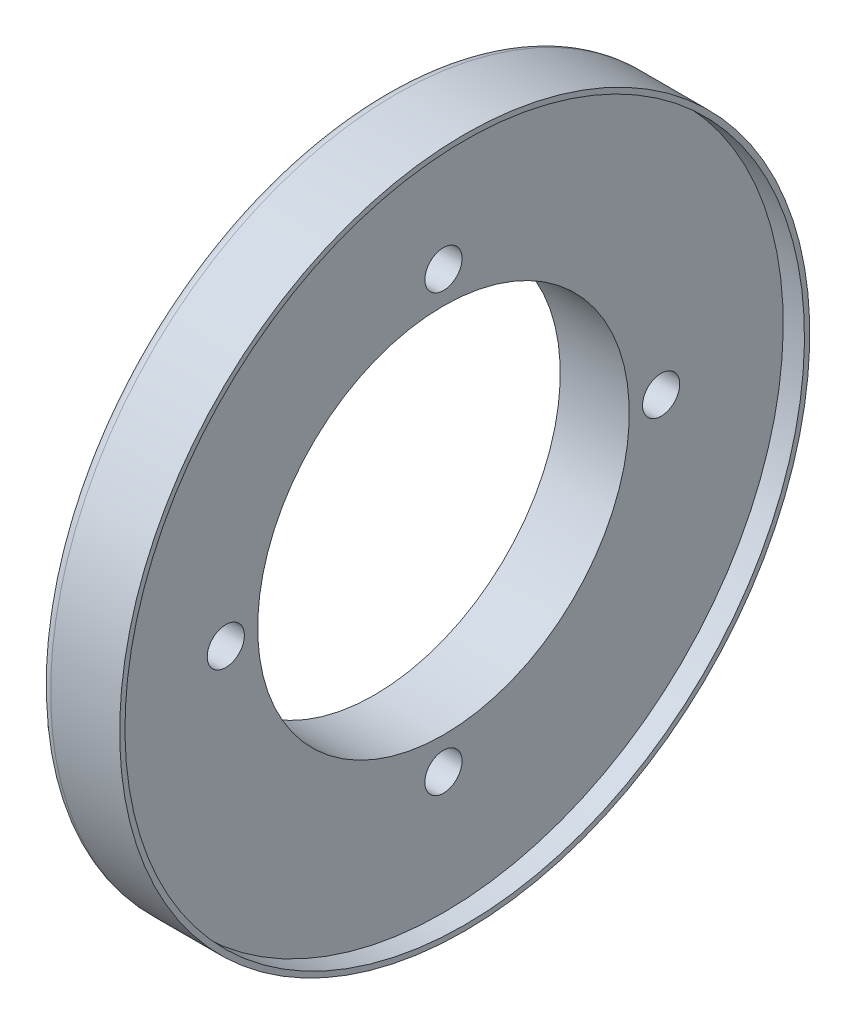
from build123d import *

# Parameters (mm, degrees)
SKIZZE2_R                       = 3.5
SCHNITT_LINEAR_AUSTRAGEN1_DEPTH = 93.838569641


with BuildPart() as part:
    # Skizze1 → Rotation1 (revolve)
    with BuildSketch(Plane.XY, mode=Mode.PRIVATE) as rotation1_sk:
        with BuildLine():
            Line((0, 35), (0, 47))
            Line((0, 47), (2, 47))
            Line((2, 47), (2, 63))
            ThreePointArc((2, 63), (2.585786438, 64.414213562), (4, 65))
            Line((4, 65), (17, 65))
            Line((17, 65), (17, 64))
            Line((17, 64), (13, 64))
            Line((13, 64), (13, 35))
            Line((13, 35), (0, 35))
        make_face()
    revolve(rotation1_sk.sketch.rotate(Axis((-23.952527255, 0, 0), (1, 0, 0)), 180), axis=Axis((-23.952527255, 0, 0), (1, 0, 0)))

    # Skizze2 → Schnitt-Linear austragen1 (cut, through all)
    with BuildSketch(Plane(origin=(13, 0, 0), x_dir=(0, 0, -1), z_dir=(1, 0, 0))):
        with Locations(Location((41, 0, 0), (0, 0, 90))):
            Circle(SKIZZE2_R)
        with Locations(Location((0, -41, 0), (0, 0, 90))):
            Circle(SKIZZE2_R)
        with Locations(Location((-41, 0, 0), (0, 0, 90))):
            Circle(SKIZZE2_R)
        with Locations(Location((0, 41, 0), (0, 0, 90))):
            Circle(SKIZZE2_R)
    extrude(amount=-SCHNITT_LINEAR_AUSTRAGEN1_DEPTH, mode=Mode.SUBTRACT)


solid = part.part
